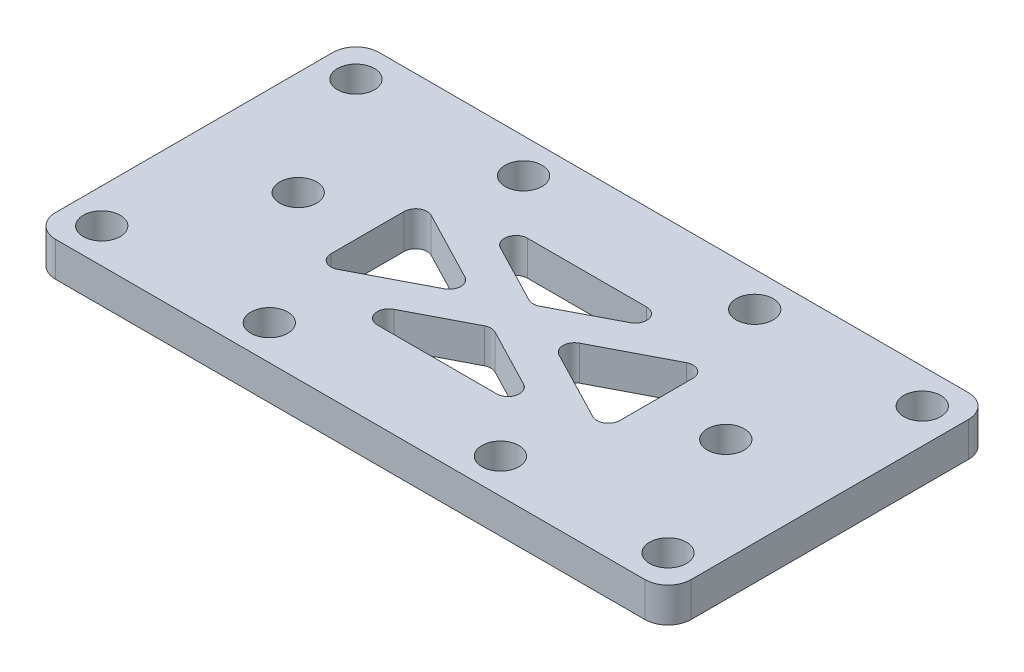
ISO-10303-21;
HEADER;
FILE_DESCRIPTION(('STEP AP214'),'2;1');
FILE_NAME('part.step','',(''),(''),'','','');
FILE_SCHEMA(('AUTOMOTIVE_DESIGN { 1 0 10303 214 1 1 1 1 }'));
ENDSEC;
DATA;
#1=APPLICATION_CONTEXT('core data for automotive mechanical design processes');
#2=APPLICATION_PROTOCOL_DEFINITION('international standard','automotive_design',2000,#1);
#3=PRODUCT_CONTEXT('',#1,'mechanical');
#4=PRODUCT('Part','Part','',(#3));
#5=PRODUCT_RELATED_PRODUCT_CATEGORY('part','',(#4));
#6=PRODUCT_DEFINITION_FORMATION('','',#4);
#7=PRODUCT_DEFINITION_CONTEXT('part definition',#1,'design');
#8=PRODUCT_DEFINITION('design','',#6,#7);
#9=PRODUCT_DEFINITION_SHAPE('','',#8);
#10=(LENGTH_UNIT() NAMED_UNIT(*) SI_UNIT(.MILLI.,.METRE.));
#11=(NAMED_UNIT(*) PLANE_ANGLE_UNIT() SI_UNIT($,.RADIAN.));
#12=(NAMED_UNIT(*) SI_UNIT($,.STERADIAN.) SOLID_ANGLE_UNIT());
#13=UNCERTAINTY_MEASURE_WITH_UNIT(LENGTH_MEASURE(1.E-05),#10,'distance_accuracy_value','');
#14=(GEOMETRIC_REPRESENTATION_CONTEXT(3) GLOBAL_UNCERTAINTY_ASSIGNED_CONTEXT((#13)) GLOBAL_UNIT_ASSIGNED_CONTEXT((#10,
#11,#12)) REPRESENTATION_CONTEXT('',''));
#15=CARTESIAN_POINT('',(0.,0.,0.));
#16=DIRECTION('',(0.,0.,1.));
#17=DIRECTION('',(1.,0.,0.));
#18=AXIS2_PLACEMENT_3D('',#15,#16,#17);
#19=CARTESIAN_POINT('',(0.,3.,0.));
#20=DIRECTION('',(0.,-1.,0.));
#21=DIRECTION('',(0.,0.,-1.));
#22=AXIS2_PLACEMENT_3D('',#19,#20,#21);
#23=PLANE('',#22);
#24=CARTESIAN_POINT('',(-18.5,3.,0.));
#25=DIRECTION('',(0.,1.,0.));
#26=DIRECTION('',(0.,0.,-1.));
#27=AXIS2_PLACEMENT_3D('',#24,#25,#26);
#28=CIRCLE('',#27,1.6);
#29=CARTESIAN_POINT('',(-18.5,3.,-1.60000000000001));
#30=VERTEX_POINT('',#29);
#31=EDGE_CURVE('E945',#30,#30,#28,.T.);
#32=ORIENTED_EDGE('',*,*,#31,.F.);
#33=EDGE_LOOP('',(#32));
#34=FACE_BOUND('',#33,.T.);
#35=CARTESIAN_POINT('',(-10.,3.,11.));
#36=DIRECTION('',(0.,1.,0.));
#37=DIRECTION('',(0.,0.,-1.));
#38=AXIS2_PLACEMENT_3D('',#35,#36,#37);
#39=CIRCLE('',#38,1.6);
#40=CARTESIAN_POINT('',(-10.,3.,9.39999999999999));
#41=VERTEX_POINT('',#40);
#42=EDGE_CURVE('E940',#41,#41,#39,.T.);
#43=ORIENTED_EDGE('',*,*,#42,.F.);
#44=EDGE_LOOP('',(#43));
#45=FACE_BOUND('',#44,.T.);
#46=CARTESIAN_POINT('',(9.99999999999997,3.,-11.));
#47=DIRECTION('',(0.,1.,0.));
#48=DIRECTION('',(0.,0.,-1.));
#49=AXIS2_PLACEMENT_3D('',#46,#47,#48);
#50=CIRCLE('',#49,1.6);
#51=CARTESIAN_POINT('',(9.99999999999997,3.,-12.6));
#52=VERTEX_POINT('',#51);
#53=EDGE_CURVE('E952',#52,#52,#50,.T.);
#54=ORIENTED_EDGE('',*,*,#53,.F.);
#55=EDGE_LOOP('',(#54));
#56=FACE_BOUND('',#55,.T.);
#57=CARTESIAN_POINT('',(-10.,3.,-11.));
#58=DIRECTION('',(0.,1.,0.));
#59=DIRECTION('',(0.,0.,1.));
#60=AXIS2_PLACEMENT_3D('',#57,#58,#59);
#61=CIRCLE('',#60,1.6);
#62=CARTESIAN_POINT('',(-10.,3.,-9.4));
#63=VERTEX_POINT('',#62);
#64=EDGE_CURVE('E953',#63,#63,#61,.T.);
#65=ORIENTED_EDGE('',*,*,#64,.F.);
#66=EDGE_LOOP('',(#65));
#67=FACE_BOUND('',#66,.T.);
#68=CARTESIAN_POINT('',(18.5,3.,0.));
#69=DIRECTION('',(0.,1.,0.));
#70=DIRECTION('',(0.,0.,1.));
#71=AXIS2_PLACEMENT_3D('',#68,#69,#70);
#72=CIRCLE('',#71,1.6);
#73=CARTESIAN_POINT('',(18.5,3.,1.6));
#74=VERTEX_POINT('',#73);
#75=EDGE_CURVE('E963',#74,#74,#72,.T.);
#76=ORIENTED_EDGE('',*,*,#75,.F.);
#77=EDGE_LOOP('',(#76));
#78=FACE_BOUND('',#77,.T.);
#79=CARTESIAN_POINT('',(10.,3.,11.));
#80=DIRECTION('',(0.,1.,0.));
#81=DIRECTION('',(0.,0.,1.));
#82=AXIS2_PLACEMENT_3D('',#79,#80,#81);
#83=CIRCLE('',#82,1.6);
#84=CARTESIAN_POINT('',(10.,3.,12.6));
#85=VERTEX_POINT('',#84);
#86=EDGE_CURVE('E935',#85,#85,#83,.T.);
#87=ORIENTED_EDGE('',*,*,#86,.F.);
#88=EDGE_LOOP('',(#87));
#89=FACE_BOUND('',#88,.T.);
#90=CARTESIAN_POINT('',(-24.5,3.,-11.));
#91=DIRECTION('',(0.,1.,0.));
#92=DIRECTION('',(0.,0.,1.));
#93=AXIS2_PLACEMENT_3D('',#90,#91,#92);
#94=CIRCLE('',#93,1.6);
#95=CARTESIAN_POINT('',(-24.5,3.,-9.40000000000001));
#96=VERTEX_POINT('',#95);
#97=EDGE_CURVE('E696',#96,#96,#94,.T.);
#98=ORIENTED_EDGE('',*,*,#97,.F.);
#99=EDGE_LOOP('',(#98));
#100=FACE_BOUND('',#99,.T.);
#101=DIRECTION('',(0.887216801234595,0.,-0.46135273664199));
#102=VECTOR('',#101,1.);
#103=CARTESIAN_POINT('',(0.692029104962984,3.,1.33082520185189));
#104=LINE('',#103,#102);
#105=CARTESIAN_POINT('',(-5.61942858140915,3.,4.6127831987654));
#106=VERTEX_POINT('',#105);
#107=CARTESIAN_POINT('',(-0.461352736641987,3.,1.93058375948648));
#108=VERTEX_POINT('',#107);
#109=EDGE_CURVE('E726',#106,#108,#104,.T.);
#110=ORIENTED_EDGE('',*,*,#109,.T.);
#111=CARTESIAN_POINT('',(0.,3.,2.81780056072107));
#112=DIRECTION('',(0.,-1.,0.));
#113=DIRECTION('',(0.,0.,-1.));
#114=AXIS2_PLACEMENT_3D('',#111,#112,#113);
#115=CIRCLE('',#114,1.);
#116=CARTESIAN_POINT('',(0.461352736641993,3.,1.93058375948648));
#117=VERTEX_POINT('',#116);
#118=EDGE_CURVE('E467',#108,#117,#115,.T.);
#119=ORIENTED_EDGE('',*,*,#118,.T.);
#120=DIRECTION('',(0.887216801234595,0.,0.46135273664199));
#121=VECTOR('',#120,1.);
#122=CARTESIAN_POINT('',(-0.692029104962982,3.,1.33082520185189));
#123=LINE('',#122,#121);
#124=CARTESIAN_POINT('',(5.61942858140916,3.,4.6127831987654));
#125=VERTEX_POINT('',#124);
#126=EDGE_CURVE('E710',#117,#125,#123,.T.);
#127=ORIENTED_EDGE('',*,*,#126,.T.);
#128=CARTESIAN_POINT('',(5.15807584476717,3.,5.5));
#129=DIRECTION('',(0.,-1.,0.));
#130=DIRECTION('',(0.,0.,-1.));
#131=AXIS2_PLACEMENT_3D('',#128,#129,#130);
#132=CIRCLE('',#131,1.);
#133=CARTESIAN_POINT('',(5.15807584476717,3.,6.5));
#134=VERTEX_POINT('',#133);
#135=EDGE_CURVE('E471',#125,#134,#132,.T.);
#136=ORIENTED_EDGE('',*,*,#135,.T.);
#137=DIRECTION('',(1.,0.,0.));
#138=VECTOR('',#137,1.);
#139=CARTESIAN_POINT('',(0.,3.,6.5));
#140=LINE('',#139,#138);
#141=CARTESIAN_POINT('',(-5.15807584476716,3.,6.5));
#142=VERTEX_POINT('',#141);
#143=EDGE_CURVE('E721',#142,#134,#140,.T.);
#144=ORIENTED_EDGE('',*,*,#143,.F.);
#145=CARTESIAN_POINT('',(-5.15807584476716,3.,5.5));
#146=DIRECTION('',(0.,-1.,0.));
#147=DIRECTION('',(0.,0.,-1.));
#148=AXIS2_PLACEMENT_3D('',#145,#146,#147);
#149=CIRCLE('',#148,1.);
#150=EDGE_CURVE('E463',#142,#106,#149,.T.);
#151=ORIENTED_EDGE('',*,*,#150,.T.);
#152=EDGE_LOOP('',(#110,#119,#127,#136,#144,#151));
#153=FACE_BOUND('',#152,.T.);
#154=CARTESIAN_POINT('',(24.5,3.,11.));
#155=DIRECTION('',(0.,1.,0.));
#156=DIRECTION('',(0.,0.,1.));
#157=AXIS2_PLACEMENT_3D('',#154,#155,#156);
#158=CIRCLE('',#157,1.6);
#159=CARTESIAN_POINT('',(24.5,3.,12.6));
#160=VERTEX_POINT('',#159);
#161=EDGE_CURVE('E913',#160,#160,#158,.F.);
#162=ORIENTED_EDGE('',*,*,#161,.T.);
#163=EDGE_LOOP('',(#162));
#164=FACE_BOUND('',#163,.T.);
#165=CARTESIAN_POINT('',(24.5,3.,-11.));
#166=DIRECTION('',(0.,1.,0.));
#167=DIRECTION('',(0.,0.,1.));
#168=AXIS2_PLACEMENT_3D('',#165,#166,#167);
#169=CIRCLE('',#168,1.6);
#170=CARTESIAN_POINT('',(24.5,3.,-9.40000000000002));
#171=VERTEX_POINT('',#170);
#172=EDGE_CURVE('E921',#171,#171,#169,.F.);
#173=ORIENTED_EDGE('',*,*,#172,.T.);
#174=EDGE_LOOP('',(#173));
#175=FACE_BOUND('',#174,.T.);
#176=DIRECTION('',(0.,0.,-1.));
#177=VECTOR('',#176,1.);
#178=CARTESIAN_POINT('',(-12.5,3.,0.));
#179=LINE('',#178,#177);
#180=CARTESIAN_POINT('',(-12.5,3.,3.16219943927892));
#181=VERTEX_POINT('',#180);
#182=CARTESIAN_POINT('',(-12.5,3.,-3.16219943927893));
#183=VERTEX_POINT('',#182);
#184=EDGE_CURVE('E499',#181,#183,#179,.T.);
#185=ORIENTED_EDGE('',*,*,#184,.T.);
#186=CARTESIAN_POINT('',(-11.5,3.,-3.16219943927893));
#187=DIRECTION('',(0.,-1.,0.));
#188=DIRECTION('',(0.,0.,-1.));
#189=AXIS2_PLACEMENT_3D('',#186,#187,#188);
#190=CIRCLE('',#189,1.);
#191=CARTESIAN_POINT('',(-11.038647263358,3.,-4.04941624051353));
#192=VERTEX_POINT('',#191);
#193=EDGE_CURVE('E487',#183,#192,#190,.T.);
#194=ORIENTED_EDGE('',*,*,#193,.T.);
#195=DIRECTION('',(0.887216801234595,0.,0.46135273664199));
#196=VECTOR('',#195,1.);
#197=CARTESIAN_POINT('',(-0.692029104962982,3.,1.33082520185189));
#198=LINE('',#197,#196);
#199=CARTESIAN_POINT('',(-4.95749449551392,3.,-0.887216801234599));
#200=VERTEX_POINT('',#199);
#201=EDGE_CURVE('E508',#192,#200,#198,.T.);
#202=ORIENTED_EDGE('',*,*,#201,.T.);
#203=CARTESIAN_POINT('',(-5.41884723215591,3.,0.));
#204=DIRECTION('',(0.,-1.,0.));
#205=DIRECTION('',(0.,0.,-1.));
#206=AXIS2_PLACEMENT_3D('',#203,#204,#205);
#207=CIRCLE('',#206,1.);
#208=CARTESIAN_POINT('',(-4.95749449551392,3.,0.887216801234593));
#209=VERTEX_POINT('',#208);
#210=EDGE_CURVE('E491',#200,#209,#207,.T.);
#211=ORIENTED_EDGE('',*,*,#210,.T.);
#212=DIRECTION('',(0.887216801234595,0.,-0.46135273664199));
#213=VECTOR('',#212,1.);
#214=CARTESIAN_POINT('',(-0.692029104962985,3.,-1.33082520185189));
#215=LINE('',#214,#213);
#216=CARTESIAN_POINT('',(-11.038647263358,3.,4.04941624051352));
#217=VERTEX_POINT('',#216);
#218=EDGE_CURVE('E500',#217,#209,#215,.T.);
#219=ORIENTED_EDGE('',*,*,#218,.F.);
#220=CARTESIAN_POINT('',(-11.5,3.,3.16219943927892));
#221=DIRECTION('',(0.,-1.,0.));
#222=DIRECTION('',(0.,0.,-1.));
#223=AXIS2_PLACEMENT_3D('',#220,#221,#222);
#224=CIRCLE('',#223,1.);
#225=EDGE_CURVE('E123',#217,#181,#224,.T.);
#226=ORIENTED_EDGE('',*,*,#225,.T.);
#227=EDGE_LOOP('',(#185,#194,#202,#211,#219,#226));
#228=FACE_BOUND('',#227,.T.);
#229=DIRECTION('',(1.,0.,0.));
#230=VECTOR('',#229,1.);
#231=CARTESIAN_POINT('',(-27.5,3.,14.));
#232=LINE('',#231,#230);
#233=CARTESIAN_POINT('',(-25.5,3.,14.));
#234=VERTEX_POINT('',#233);
#235=CARTESIAN_POINT('',(25.5,3.,14.));
#236=VERTEX_POINT('',#235);
#237=EDGE_CURVE('E360',#234,#236,#232,.T.);
#238=ORIENTED_EDGE('',*,*,#237,.T.);
#239=CARTESIAN_POINT('',(25.5,3.,12.));
#240=DIRECTION('',(0.,-1.,0.));
#241=DIRECTION('',(0.,0.,-1.));
#242=AXIS2_PLACEMENT_3D('',#239,#240,#241);
#243=CIRCLE('',#242,2.);
#244=CARTESIAN_POINT('',(27.5,3.,12.));
#245=VERTEX_POINT('',#244);
#246=EDGE_CURVE('E380',#236,#245,#243,.F.);
#247=ORIENTED_EDGE('',*,*,#246,.T.);
#248=DIRECTION('',(0.,0.,-1.));
#249=VECTOR('',#248,1.);
#250=CARTESIAN_POINT('',(27.5,3.,14.));
#251=LINE('',#250,#249);
#252=CARTESIAN_POINT('',(27.5,3.,-12.));
#253=VERTEX_POINT('',#252);
#254=EDGE_CURVE('E344',#245,#253,#251,.T.);
#255=ORIENTED_EDGE('',*,*,#254,.T.);
#256=CARTESIAN_POINT('',(25.5,3.,-12.));
#257=DIRECTION('',(0.,-1.,0.));
#258=DIRECTION('',(0.,0.,-1.));
#259=AXIS2_PLACEMENT_3D('',#256,#257,#258);
#260=CIRCLE('',#259,2.);
#261=CARTESIAN_POINT('',(25.5,3.,-14.));
#262=VERTEX_POINT('',#261);
#263=EDGE_CURVE('E376',#253,#262,#260,.F.);
#264=ORIENTED_EDGE('',*,*,#263,.T.);
#265=DIRECTION('',(-1.,0.,0.));
#266=VECTOR('',#265,1.);
#267=CARTESIAN_POINT('',(-27.5,3.,-14.));
#268=LINE('',#267,#266);
#269=CARTESIAN_POINT('',(-25.5,3.,-14.));
#270=VERTEX_POINT('',#269);
#271=EDGE_CURVE('E533',#262,#270,#268,.T.);
#272=ORIENTED_EDGE('',*,*,#271,.T.);
#273=CARTESIAN_POINT('',(-25.5,3.,-12.));
#274=DIRECTION('',(0.,-1.,0.));
#275=DIRECTION('',(0.,0.,-1.));
#276=AXIS2_PLACEMENT_3D('',#273,#274,#275);
#277=CIRCLE('',#276,2.);
#278=CARTESIAN_POINT('',(-27.5,3.,-12.));
#279=VERTEX_POINT('',#278);
#280=EDGE_CURVE('E374',#270,#279,#277,.F.);
#281=ORIENTED_EDGE('',*,*,#280,.T.);
#282=DIRECTION('',(0.,0.,1.));
#283=VECTOR('',#282,1.);
#284=CARTESIAN_POINT('',(-27.5,3.,14.));
#285=LINE('',#284,#283);
#286=CARTESIAN_POINT('',(-27.5,3.,12.));
#287=VERTEX_POINT('',#286);
#288=EDGE_CURVE('E535',#279,#287,#285,.T.);
#289=ORIENTED_EDGE('',*,*,#288,.T.);
#290=CARTESIAN_POINT('',(-25.5,3.,12.));
#291=DIRECTION('',(0.,-1.,0.));
#292=DIRECTION('',(0.,0.,-1.));
#293=AXIS2_PLACEMENT_3D('',#290,#291,#292);
#294=CIRCLE('',#293,2.);
#295=EDGE_CURVE('E378',#287,#234,#294,.F.);
#296=ORIENTED_EDGE('',*,*,#295,.T.);
#297=EDGE_LOOP('',(#238,#247,#255,#264,#272,#281,#289,#296));
#298=FACE_BOUND('',#297,.T.);
#299=CARTESIAN_POINT('',(-24.5,3.,11.));
#300=DIRECTION('',(0.,1.,0.));
#301=DIRECTION('',(0.,0.,1.));
#302=AXIS2_PLACEMENT_3D('',#299,#300,#301);
#303=CIRCLE('',#302,1.6);
#304=CARTESIAN_POINT('',(-24.5,3.,12.6));
#305=VERTEX_POINT('',#304);
#306=EDGE_CURVE('E908',#305,#305,#303,.T.);
#307=ORIENTED_EDGE('',*,*,#306,.F.);
#308=EDGE_LOOP('',(#307));
#309=FACE_BOUND('',#308,.T.);
#310=DIRECTION('',(0.887216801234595,0.,0.46135273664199));
#311=VECTOR('',#310,1.);
#312=CARTESIAN_POINT('',(0.692029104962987,3.,-1.3308252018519));
#313=LINE('',#312,#311);
#314=CARTESIAN_POINT('',(4.95749449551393,3.,0.887216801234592));
#315=VERTEX_POINT('',#314);
#316=CARTESIAN_POINT('',(11.038647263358,3.,4.04941624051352));
#317=VERTEX_POINT('',#316);
#318=EDGE_CURVE('E713',#315,#317,#313,.T.);
#319=ORIENTED_EDGE('',*,*,#318,.F.);
#320=CARTESIAN_POINT('',(5.41884723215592,3.,0.));
#321=DIRECTION('',(0.,-1.,0.));
#322=DIRECTION('',(0.,0.,-1.));
#323=AXIS2_PLACEMENT_3D('',#320,#321,#322);
#324=CIRCLE('',#323,1.);
#325=CARTESIAN_POINT('',(4.95749449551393,3.,-0.8872168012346));
#326=VERTEX_POINT('',#325);
#327=EDGE_CURVE('E479',#315,#326,#324,.T.);
#328=ORIENTED_EDGE('',*,*,#327,.T.);
#329=DIRECTION('',(0.887216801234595,0.,-0.46135273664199));
#330=VECTOR('',#329,1.);
#331=CARTESIAN_POINT('',(0.692029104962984,3.,1.33082520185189));
#332=LINE('',#331,#330);
#333=CARTESIAN_POINT('',(11.038647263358,3.,-4.04941624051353));
#334=VERTEX_POINT('',#333);
#335=EDGE_CURVE('E672',#326,#334,#332,.T.);
#336=ORIENTED_EDGE('',*,*,#335,.T.);
#337=CARTESIAN_POINT('',(11.5,3.,-3.16219943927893));
#338=DIRECTION('',(0.,-1.,0.));
#339=DIRECTION('',(0.,0.,-1.));
#340=AXIS2_PLACEMENT_3D('',#337,#338,#339);
#341=CIRCLE('',#340,1.);
#342=CARTESIAN_POINT('',(12.5,3.,-3.16219943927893));
#343=VERTEX_POINT('',#342);
#344=EDGE_CURVE('E483',#334,#343,#341,.T.);
#345=ORIENTED_EDGE('',*,*,#344,.T.);
#346=DIRECTION('',(0.,0.,-1.));
#347=VECTOR('',#346,1.);
#348=CARTESIAN_POINT('',(12.5,3.,0.));
#349=LINE('',#348,#347);
#350=CARTESIAN_POINT('',(12.5,3.,3.16219943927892));
#351=VERTEX_POINT('',#350);
#352=EDGE_CURVE('E704',#351,#343,#349,.T.);
#353=ORIENTED_EDGE('',*,*,#352,.F.);
#354=CARTESIAN_POINT('',(11.5,3.,3.16219943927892));
#355=DIRECTION('',(0.,-1.,0.));
#356=DIRECTION('',(0.,0.,-1.));
#357=AXIS2_PLACEMENT_3D('',#354,#355,#356);
#358=CIRCLE('',#357,1.);
#359=EDGE_CURVE('E475',#351,#317,#358,.T.);
#360=ORIENTED_EDGE('',*,*,#359,.T.);
#361=EDGE_LOOP('',(#319,#328,#336,#345,#353,#360));
#362=FACE_BOUND('',#361,.T.);
#363=DIRECTION('',(0.887216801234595,0.,0.46135273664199));
#364=VECTOR('',#363,1.);
#365=CARTESIAN_POINT('',(0.692029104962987,3.,-1.3308252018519));
#366=LINE('',#365,#364);
#367=CARTESIAN_POINT('',(-5.61942858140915,3.,-4.61278319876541));
#368=VERTEX_POINT('',#367);
#369=CARTESIAN_POINT('',(-0.461352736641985,3.,-1.93058375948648));
#370=VERTEX_POINT('',#369);
#371=EDGE_CURVE('E681',#368,#370,#366,.T.);
#372=ORIENTED_EDGE('',*,*,#371,.F.);
#373=CARTESIAN_POINT('',(-5.15807584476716,3.,-5.5));
#374=DIRECTION('',(0.,-1.,0.));
#375=DIRECTION('',(0.,0.,-1.));
#376=AXIS2_PLACEMENT_3D('',#373,#374,#375);
#377=CIRCLE('',#376,1.);
#378=CARTESIAN_POINT('',(-5.15807584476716,3.,-6.5));
#379=VERTEX_POINT('',#378);
#380=EDGE_CURVE('E455',#368,#379,#377,.T.);
#381=ORIENTED_EDGE('',*,*,#380,.T.);
#382=DIRECTION('',(1.,0.,0.));
#383=VECTOR('',#382,1.);
#384=CARTESIAN_POINT('',(0.,3.,-6.5));
#385=LINE('',#384,#383);
#386=CARTESIAN_POINT('',(5.15807584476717,3.,-6.5));
#387=VERTEX_POINT('',#386);
#388=EDGE_CURVE('E686',#379,#387,#385,.T.);
#389=ORIENTED_EDGE('',*,*,#388,.T.);
#390=CARTESIAN_POINT('',(5.15807584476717,3.,-5.5));
#391=DIRECTION('',(0.,-1.,0.));
#392=DIRECTION('',(0.,0.,-1.));
#393=AXIS2_PLACEMENT_3D('',#390,#391,#392);
#394=CIRCLE('',#393,1.);
#395=CARTESIAN_POINT('',(5.61942858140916,3.,-4.61278319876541));
#396=VERTEX_POINT('',#395);
#397=EDGE_CURVE('E459',#387,#396,#394,.T.);
#398=ORIENTED_EDGE('',*,*,#397,.T.);
#399=DIRECTION('',(0.887216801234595,0.,-0.46135273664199));
#400=VECTOR('',#399,1.);
#401=CARTESIAN_POINT('',(-0.692029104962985,3.,-1.33082520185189));
#402=LINE('',#401,#400);
#403=CARTESIAN_POINT('',(0.461352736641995,3.,-1.93058375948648));
#404=VERTEX_POINT('',#403);
#405=EDGE_CURVE('E682',#404,#396,#402,.T.);
#406=ORIENTED_EDGE('',*,*,#405,.F.);
#407=CARTESIAN_POINT('',(0.,3.,-2.81780056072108));
#408=DIRECTION('',(0.,-1.,0.));
#409=DIRECTION('',(0.,0.,-1.));
#410=AXIS2_PLACEMENT_3D('',#407,#408,#409);
#411=CIRCLE('',#410,1.);
#412=EDGE_CURVE('E451',#404,#370,#411,.T.);
#413=ORIENTED_EDGE('',*,*,#412,.T.);
#414=EDGE_LOOP('',(#372,#381,#389,#398,#406,#413));
#415=FACE_BOUND('',#414,.T.);
#416=ADVANCED_FACE('F115',(#34,#45,#56,#67,#78,#89,#100,#153,#164,#175,#228,#298,#309,#362,
#415),#23,.F.);
#417=CARTESIAN_POINT('',(0.,0.,0.));
#418=DIRECTION('',(0.,-1.,0.));
#419=DIRECTION('',(0.,0.,-1.));
#420=AXIS2_PLACEMENT_3D('',#417,#418,#419);
#421=PLANE('',#420);
#422=CARTESIAN_POINT('',(-18.5,0.,0.));
#423=DIRECTION('',(0.,1.,0.));
#424=DIRECTION('',(0.,0.,-1.));
#425=AXIS2_PLACEMENT_3D('',#422,#423,#424);
#426=CIRCLE('',#425,1.6);
#427=CARTESIAN_POINT('',(-18.5,0.,-1.60000000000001));
#428=VERTEX_POINT('',#427);
#429=EDGE_CURVE('E942',#428,#428,#426,.T.);
#430=ORIENTED_EDGE('',*,*,#429,.T.);
#431=EDGE_LOOP('',(#430));
#432=FACE_BOUND('',#431,.T.);
#433=CARTESIAN_POINT('',(-10.,0.,11.));
#434=DIRECTION('',(0.,1.,0.));
#435=DIRECTION('',(0.,0.,-1.));
#436=AXIS2_PLACEMENT_3D('',#433,#434,#435);
#437=CIRCLE('',#436,1.6);
#438=CARTESIAN_POINT('',(-10.,0.,9.39999999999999));
#439=VERTEX_POINT('',#438);
#440=EDGE_CURVE('E956',#439,#439,#437,.T.);
#441=ORIENTED_EDGE('',*,*,#440,.T.);
#442=EDGE_LOOP('',(#441));
#443=FACE_BOUND('',#442,.T.);
#444=CARTESIAN_POINT('',(9.99999999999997,0.,-11.));
#445=DIRECTION('',(0.,1.,0.));
#446=DIRECTION('',(0.,0.,-1.));
#447=AXIS2_PLACEMENT_3D('',#444,#445,#446);
#448=CIRCLE('',#447,1.6);
#449=CARTESIAN_POINT('',(9.99999999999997,0.,-12.6));
#450=VERTEX_POINT('',#449);
#451=EDGE_CURVE('E949',#450,#450,#448,.T.);
#452=ORIENTED_EDGE('',*,*,#451,.T.);
#453=EDGE_LOOP('',(#452));
#454=FACE_BOUND('',#453,.T.);
#455=CARTESIAN_POINT('',(-10.,0.,-11.));
#456=DIRECTION('',(0.,1.,0.));
#457=DIRECTION('',(0.,0.,1.));
#458=AXIS2_PLACEMENT_3D('',#455,#456,#457);
#459=CIRCLE('',#458,1.6);
#460=CARTESIAN_POINT('',(-10.,0.,-9.4));
#461=VERTEX_POINT('',#460);
#462=EDGE_CURVE('E966',#461,#461,#459,.T.);
#463=ORIENTED_EDGE('',*,*,#462,.T.);
#464=EDGE_LOOP('',(#463));
#465=FACE_BOUND('',#464,.T.);
#466=CARTESIAN_POINT('',(18.5,0.,0.));
#467=DIRECTION('',(0.,1.,0.));
#468=DIRECTION('',(0.,0.,1.));
#469=AXIS2_PLACEMENT_3D('',#466,#467,#468);
#470=CIRCLE('',#469,1.6);
#471=CARTESIAN_POINT('',(18.5,0.,1.6));
#472=VERTEX_POINT('',#471);
#473=EDGE_CURVE('E948',#472,#472,#470,.T.);
#474=ORIENTED_EDGE('',*,*,#473,.T.);
#475=EDGE_LOOP('',(#474));
#476=FACE_BOUND('',#475,.T.);
#477=CARTESIAN_POINT('',(10.,0.,11.));
#478=DIRECTION('',(0.,1.,0.));
#479=DIRECTION('',(0.,0.,1.));
#480=AXIS2_PLACEMENT_3D('',#477,#478,#479);
#481=CIRCLE('',#480,1.6);
#482=CARTESIAN_POINT('',(10.,0.,12.6));
#483=VERTEX_POINT('',#482);
#484=EDGE_CURVE('E924',#483,#483,#481,.T.);
#485=ORIENTED_EDGE('',*,*,#484,.T.);
#486=EDGE_LOOP('',(#485));
#487=FACE_BOUND('',#486,.T.);
#488=CARTESIAN_POINT('',(-24.5,0.,-11.));
#489=DIRECTION('',(0.,1.,0.));
#490=DIRECTION('',(0.,0.,1.));
#491=AXIS2_PLACEMENT_3D('',#488,#489,#490);
#492=CIRCLE('',#491,1.6);
#493=CARTESIAN_POINT('',(-24.5,0.,-9.40000000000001));
#494=VERTEX_POINT('',#493);
#495=EDGE_CURVE('E691',#494,#494,#492,.T.);
#496=ORIENTED_EDGE('',*,*,#495,.T.);
#497=EDGE_LOOP('',(#496));
#498=FACE_BOUND('',#497,.T.);
#499=CARTESIAN_POINT('',(-24.5,0.,11.));
#500=DIRECTION('',(0.,1.,0.));
#501=DIRECTION('',(0.,0.,1.));
#502=AXIS2_PLACEMENT_3D('',#499,#500,#501);
#503=CIRCLE('',#502,1.6);
#504=CARTESIAN_POINT('',(-24.5,0.,12.6));
#505=VERTEX_POINT('',#504);
#506=EDGE_CURVE('E699',#505,#505,#503,.T.);
#507=ORIENTED_EDGE('',*,*,#506,.T.);
#508=EDGE_LOOP('',(#507));
#509=FACE_BOUND('',#508,.T.);
#510=CARTESIAN_POINT('',(24.5,0.,-11.));
#511=DIRECTION('',(0.,1.,0.));
#512=DIRECTION('',(0.,0.,1.));
#513=AXIS2_PLACEMENT_3D('',#510,#511,#512);
#514=CIRCLE('',#513,1.6);
#515=CARTESIAN_POINT('',(24.5,0.,-9.40000000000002));
#516=VERTEX_POINT('',#515);
#517=EDGE_CURVE('E919',#516,#516,#514,.F.);
#518=ORIENTED_EDGE('',*,*,#517,.F.);
#519=EDGE_LOOP('',(#518));
#520=FACE_BOUND('',#519,.T.);
#521=DIRECTION('',(0.,0.,-1.));
#522=VECTOR('',#521,1.);
#523=CARTESIAN_POINT('',(27.5,0.,14.));
#524=LINE('',#523,#522);
#525=CARTESIAN_POINT('',(27.5,0.,12.));
#526=VERTEX_POINT('',#525);
#527=CARTESIAN_POINT('',(27.5,0.,-12.));
#528=VERTEX_POINT('',#527);
#529=EDGE_CURVE('E341',#526,#528,#524,.T.);
#530=ORIENTED_EDGE('',*,*,#529,.F.);
#531=CARTESIAN_POINT('',(25.5,0.,12.));
#532=DIRECTION('',(0.,-1.,0.));
#533=DIRECTION('',(0.,0.,-1.));
#534=AXIS2_PLACEMENT_3D('',#531,#532,#533);
#535=CIRCLE('',#534,2.);
#536=CARTESIAN_POINT('',(25.5,0.,14.));
#537=VERTEX_POINT('',#536);
#538=EDGE_CURVE('E324',#526,#537,#535,.T.);
#539=ORIENTED_EDGE('',*,*,#538,.T.);
#540=DIRECTION('',(1.,0.,0.));
#541=VECTOR('',#540,1.);
#542=CARTESIAN_POINT('',(-27.5,0.,14.));
#543=LINE('',#542,#541);
#544=CARTESIAN_POINT('',(-25.5,0.,14.));
#545=VERTEX_POINT('',#544);
#546=EDGE_CURVE('E365',#545,#537,#543,.T.);
#547=ORIENTED_EDGE('',*,*,#546,.F.);
#548=CARTESIAN_POINT('',(-25.5,0.,12.));
#549=DIRECTION('',(0.,-1.,0.));
#550=DIRECTION('',(0.,0.,-1.));
#551=AXIS2_PLACEMENT_3D('',#548,#549,#550);
#552=CIRCLE('',#551,2.);
#553=CARTESIAN_POINT('',(-27.5,0.,12.));
#554=VERTEX_POINT('',#553);
#555=EDGE_CURVE('E335',#545,#554,#552,.T.);
#556=ORIENTED_EDGE('',*,*,#555,.T.);
#557=DIRECTION('',(0.,0.,1.));
#558=VECTOR('',#557,1.);
#559=CARTESIAN_POINT('',(-27.5,0.,14.));
#560=LINE('',#559,#558);
#561=CARTESIAN_POINT('',(-27.5,0.,-12.));
#562=VERTEX_POINT('',#561);
#563=EDGE_CURVE('E355',#562,#554,#560,.T.);
#564=ORIENTED_EDGE('',*,*,#563,.F.);
#565=CARTESIAN_POINT('',(-25.5,0.,-12.));
#566=DIRECTION('',(0.,-1.,0.));
#567=DIRECTION('',(0.,0.,-1.));
#568=AXIS2_PLACEMENT_3D('',#565,#566,#567);
#569=CIRCLE('',#568,2.);
#570=CARTESIAN_POINT('',(-25.5,0.,-14.));
#571=VERTEX_POINT('',#570);
#572=EDGE_CURVE('E345',#562,#571,#569,.T.);
#573=ORIENTED_EDGE('',*,*,#572,.T.);
#574=DIRECTION('',(-1.,0.,0.));
#575=VECTOR('',#574,1.);
#576=CARTESIAN_POINT('',(-27.5,0.,-14.));
#577=LINE('',#576,#575);
#578=CARTESIAN_POINT('',(25.5,0.,-14.));
#579=VERTEX_POINT('',#578);
#580=EDGE_CURVE('E351',#579,#571,#577,.T.);
#581=ORIENTED_EDGE('',*,*,#580,.F.);
#582=CARTESIAN_POINT('',(25.5,0.,-12.));
#583=DIRECTION('',(0.,-1.,0.));
#584=DIRECTION('',(0.,0.,-1.));
#585=AXIS2_PLACEMENT_3D('',#582,#583,#584);
#586=CIRCLE('',#585,2.);
#587=EDGE_CURVE('E350',#579,#528,#586,.T.);
#588=ORIENTED_EDGE('',*,*,#587,.T.);
#589=EDGE_LOOP('',(#530,#539,#547,#556,#564,#573,#581,#588));
#590=FACE_BOUND('',#589,.T.);
#591=DIRECTION('',(0.,0.,-1.));
#592=VECTOR('',#591,1.);
#593=CARTESIAN_POINT('',(-12.5,0.,0.));
#594=LINE('',#593,#592);
#595=CARTESIAN_POINT('',(-12.5,0.,3.16219943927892));
#596=VERTEX_POINT('',#595);
#597=CARTESIAN_POINT('',(-12.5,0.,-3.16219943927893));
#598=VERTEX_POINT('',#597);
#599=EDGE_CURVE('E357',#596,#598,#594,.T.);
#600=ORIENTED_EDGE('',*,*,#599,.F.);
#601=CARTESIAN_POINT('',(-11.5,0.,3.16219943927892));
#602=DIRECTION('',(0.,-1.,0.));
#603=DIRECTION('',(0.,0.,-1.));
#604=AXIS2_PLACEMENT_3D('',#601,#602,#603);
#605=CIRCLE('',#604,1.);
#606=CARTESIAN_POINT('',(-11.038647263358,0.,4.04941624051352));
#607=VERTEX_POINT('',#606);
#608=EDGE_CURVE('E12',#596,#607,#605,.F.);
#609=ORIENTED_EDGE('',*,*,#608,.T.);
#610=DIRECTION('',(0.887216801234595,0.,-0.46135273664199));
#611=VECTOR('',#610,1.);
#612=CARTESIAN_POINT('',(-0.692029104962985,0.,-1.33082520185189));
#613=LINE('',#612,#611);
#614=CARTESIAN_POINT('',(-4.95749449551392,0.,0.887216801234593));
#615=VERTEX_POINT('',#614);
#616=EDGE_CURVE('E352',#607,#615,#613,.T.);
#617=ORIENTED_EDGE('',*,*,#616,.T.);
#618=CARTESIAN_POINT('',(-5.41884723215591,0.,0.));
#619=DIRECTION('',(0.,-1.,0.));
#620=DIRECTION('',(0.,0.,-1.));
#621=AXIS2_PLACEMENT_3D('',#618,#619,#620);
#622=CIRCLE('',#621,1.);
#623=CARTESIAN_POINT('',(-4.95749449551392,0.,-0.887216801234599));
#624=VERTEX_POINT('',#623);
#625=EDGE_CURVE('E493',#615,#624,#622,.F.);
#626=ORIENTED_EDGE('',*,*,#625,.T.);
#627=DIRECTION('',(0.887216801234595,0.,0.46135273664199));
#628=VECTOR('',#627,1.);
#629=CARTESIAN_POINT('',(-0.692029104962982,0.,1.33082520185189));
#630=LINE('',#629,#628);
#631=CARTESIAN_POINT('',(-11.038647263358,0.,-4.04941624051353));
#632=VERTEX_POINT('',#631);
#633=EDGE_CURVE('E523',#632,#624,#630,.T.);
#634=ORIENTED_EDGE('',*,*,#633,.F.);
#635=CARTESIAN_POINT('',(-11.5,0.,-3.16219943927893));
#636=DIRECTION('',(0.,-1.,0.));
#637=DIRECTION('',(0.,0.,-1.));
#638=AXIS2_PLACEMENT_3D('',#635,#636,#637);
#639=CIRCLE('',#638,1.);
#640=EDGE_CURVE('E489',#632,#598,#639,.F.);
#641=ORIENTED_EDGE('',*,*,#640,.T.);
#642=EDGE_LOOP('',(#600,#609,#617,#626,#634,#641));
#643=FACE_BOUND('',#642,.T.);
#644=CARTESIAN_POINT('',(24.5,0.,11.));
#645=DIRECTION('',(0.,1.,0.));
#646=DIRECTION('',(0.,0.,1.));
#647=AXIS2_PLACEMENT_3D('',#644,#645,#646);
#648=CIRCLE('',#647,1.6);
#649=CARTESIAN_POINT('',(24.5,0.,12.6));
#650=VERTEX_POINT('',#649);
#651=EDGE_CURVE('E909',#650,#650,#648,.F.);
#652=ORIENTED_EDGE('',*,*,#651,.F.);
#653=EDGE_LOOP('',(#652));
#654=FACE_BOUND('',#653,.T.);
#655=DIRECTION('',(0.887216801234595,0.,0.46135273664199));
#656=VECTOR('',#655,1.);
#657=CARTESIAN_POINT('',(0.692029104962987,0.,-1.3308252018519));
#658=LINE('',#657,#656);
#659=CARTESIAN_POINT('',(4.95749449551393,0.,0.887216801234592));
#660=VERTEX_POINT('',#659);
#661=CARTESIAN_POINT('',(11.038647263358,0.,4.04941624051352));
#662=VERTEX_POINT('',#661);
#663=EDGE_CURVE('E703',#660,#662,#658,.T.);
#664=ORIENTED_EDGE('',*,*,#663,.T.);
#665=CARTESIAN_POINT('',(11.5,0.,3.16219943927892));
#666=DIRECTION('',(0.,-1.,0.));
#667=DIRECTION('',(0.,0.,-1.));
#668=AXIS2_PLACEMENT_3D('',#665,#666,#667);
#669=CIRCLE('',#668,1.);
#670=CARTESIAN_POINT('',(12.5,0.,3.16219943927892));
#671=VERTEX_POINT('',#670);
#672=EDGE_CURVE('E477',#662,#671,#669,.F.);
#673=ORIENTED_EDGE('',*,*,#672,.T.);
#674=DIRECTION('',(0.,0.,-1.));
#675=VECTOR('',#674,1.);
#676=CARTESIAN_POINT('',(12.5,0.,0.));
#677=LINE('',#676,#675);
#678=CARTESIAN_POINT('',(12.5,0.,-3.16219943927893));
#679=VERTEX_POINT('',#678);
#680=EDGE_CURVE('E707',#671,#679,#677,.T.);
#681=ORIENTED_EDGE('',*,*,#680,.T.);
#682=CARTESIAN_POINT('',(11.5,0.,-3.16219943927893));
#683=DIRECTION('',(0.,-1.,0.));
#684=DIRECTION('',(0.,0.,-1.));
#685=AXIS2_PLACEMENT_3D('',#682,#683,#684);
#686=CIRCLE('',#685,1.);
#687=CARTESIAN_POINT('',(11.038647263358,0.,-4.04941624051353));
#688=VERTEX_POINT('',#687);
#689=EDGE_CURVE('E485',#679,#688,#686,.F.);
#690=ORIENTED_EDGE('',*,*,#689,.T.);
#691=DIRECTION('',(0.887216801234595,0.,-0.46135273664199));
#692=VECTOR('',#691,1.);
#693=CARTESIAN_POINT('',(0.692029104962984,0.,1.33082520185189));
#694=LINE('',#693,#692);
#695=CARTESIAN_POINT('',(4.95749449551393,0.,-0.8872168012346));
#696=VERTEX_POINT('',#695);
#697=EDGE_CURVE('E700',#696,#688,#694,.T.);
#698=ORIENTED_EDGE('',*,*,#697,.F.);
#699=CARTESIAN_POINT('',(5.41884723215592,0.,0.));
#700=DIRECTION('',(0.,-1.,0.));
#701=DIRECTION('',(0.,0.,-1.));
#702=AXIS2_PLACEMENT_3D('',#699,#700,#701);
#703=CIRCLE('',#702,1.);
#704=EDGE_CURVE('E481',#696,#660,#703,.F.);
#705=ORIENTED_EDGE('',*,*,#704,.T.);
#706=EDGE_LOOP('',(#664,#673,#681,#690,#698,#705));
#707=FACE_BOUND('',#706,.T.);
#708=DIRECTION('',(0.887216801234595,0.,-0.46135273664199));
#709=VECTOR('',#708,1.);
#710=CARTESIAN_POINT('',(0.692029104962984,0.,1.33082520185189));
#711=LINE('',#710,#709);
#712=CARTESIAN_POINT('',(-5.61942858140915,0.,4.6127831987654));
#713=VERTEX_POINT('',#712);
#714=CARTESIAN_POINT('',(-0.461352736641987,0.,1.93058375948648));
#715=VERTEX_POINT('',#714);
#716=EDGE_CURVE('E527',#713,#715,#711,.T.);
#717=ORIENTED_EDGE('',*,*,#716,.F.);
#718=CARTESIAN_POINT('',(-5.15807584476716,0.,5.5));
#719=DIRECTION('',(0.,-1.,0.));
#720=DIRECTION('',(0.,0.,-1.));
#721=AXIS2_PLACEMENT_3D('',#718,#719,#720);
#722=CIRCLE('',#721,1.);
#723=CARTESIAN_POINT('',(-5.15807584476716,0.,6.5));
#724=VERTEX_POINT('',#723);
#725=EDGE_CURVE('E465',#713,#724,#722,.F.);
#726=ORIENTED_EDGE('',*,*,#725,.T.);
#727=DIRECTION('',(1.,0.,0.));
#728=VECTOR('',#727,1.);
#729=CARTESIAN_POINT('',(0.,0.,6.5));
#730=LINE('',#729,#728);
#731=CARTESIAN_POINT('',(5.15807584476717,0.,6.5));
#732=VERTEX_POINT('',#731);
#733=EDGE_CURVE('E524',#724,#732,#730,.T.);
#734=ORIENTED_EDGE('',*,*,#733,.T.);
#735=CARTESIAN_POINT('',(5.15807584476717,0.,5.5));
#736=DIRECTION('',(0.,-1.,0.));
#737=DIRECTION('',(0.,0.,-1.));
#738=AXIS2_PLACEMENT_3D('',#735,#736,#737);
#739=CIRCLE('',#738,1.);
#740=CARTESIAN_POINT('',(5.61942858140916,0.,4.6127831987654));
#741=VERTEX_POINT('',#740);
#742=EDGE_CURVE('E473',#732,#741,#739,.F.);
#743=ORIENTED_EDGE('',*,*,#742,.T.);
#744=DIRECTION('',(0.887216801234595,0.,0.46135273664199));
#745=VECTOR('',#744,1.);
#746=CARTESIAN_POINT('',(-0.692029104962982,0.,1.33082520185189));
#747=LINE('',#746,#745);
#748=CARTESIAN_POINT('',(0.461352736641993,0.,1.93058375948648));
#749=VERTEX_POINT('',#748);
#750=EDGE_CURVE('E718',#749,#741,#747,.T.);
#751=ORIENTED_EDGE('',*,*,#750,.F.);
#752=CARTESIAN_POINT('',(0.,0.,2.81780056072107));
#753=DIRECTION('',(0.,-1.,0.));
#754=DIRECTION('',(0.,0.,-1.));
#755=AXIS2_PLACEMENT_3D('',#752,#753,#754);
#756=CIRCLE('',#755,1.);
#757=EDGE_CURVE('E469',#749,#715,#756,.F.);
#758=ORIENTED_EDGE('',*,*,#757,.T.);
#759=EDGE_LOOP('',(#717,#726,#734,#743,#751,#758));
#760=FACE_BOUND('',#759,.T.);
#761=DIRECTION('',(0.887216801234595,0.,0.46135273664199));
#762=VECTOR('',#761,1.);
#763=CARTESIAN_POINT('',(0.692029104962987,0.,-1.3308252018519));
#764=LINE('',#763,#762);
#765=CARTESIAN_POINT('',(-5.61942858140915,0.,-4.61278319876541));
#766=VERTEX_POINT('',#765);
#767=CARTESIAN_POINT('',(-0.461352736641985,0.,-1.93058375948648));
#768=VERTEX_POINT('',#767);
#769=EDGE_CURVE('E673',#766,#768,#764,.T.);
#770=ORIENTED_EDGE('',*,*,#769,.T.);
#771=CARTESIAN_POINT('',(0.,0.,-2.81780056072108));
#772=DIRECTION('',(0.,-1.,0.));
#773=DIRECTION('',(0.,0.,-1.));
#774=AXIS2_PLACEMENT_3D('',#771,#772,#773);
#775=CIRCLE('',#774,1.);
#776=CARTESIAN_POINT('',(0.461352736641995,0.,-1.93058375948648));
#777=VERTEX_POINT('',#776);
#778=EDGE_CURVE('E453',#768,#777,#775,.F.);
#779=ORIENTED_EDGE('',*,*,#778,.T.);
#780=DIRECTION('',(0.887216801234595,0.,-0.46135273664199));
#781=VECTOR('',#780,1.);
#782=CARTESIAN_POINT('',(-0.692029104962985,0.,-1.33082520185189));
#783=LINE('',#782,#781);
#784=CARTESIAN_POINT('',(5.61942858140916,0.,-4.61278319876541));
#785=VERTEX_POINT('',#784);
#786=EDGE_CURVE('E665',#777,#785,#783,.T.);
#787=ORIENTED_EDGE('',*,*,#786,.T.);
#788=CARTESIAN_POINT('',(5.15807584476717,0.,-5.5));
#789=DIRECTION('',(0.,-1.,0.));
#790=DIRECTION('',(0.,0.,-1.));
#791=AXIS2_PLACEMENT_3D('',#788,#789,#790);
#792=CIRCLE('',#791,1.);
#793=CARTESIAN_POINT('',(5.15807584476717,0.,-6.5));
#794=VERTEX_POINT('',#793);
#795=EDGE_CURVE('E461',#785,#794,#792,.F.);
#796=ORIENTED_EDGE('',*,*,#795,.T.);
#797=DIRECTION('',(1.,0.,0.));
#798=VECTOR('',#797,1.);
#799=CARTESIAN_POINT('',(0.,0.,-6.5));
#800=LINE('',#799,#798);
#801=CARTESIAN_POINT('',(-5.15807584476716,0.,-6.5));
#802=VERTEX_POINT('',#801);
#803=EDGE_CURVE('E688',#802,#794,#800,.T.);
#804=ORIENTED_EDGE('',*,*,#803,.F.);
#805=CARTESIAN_POINT('',(-5.15807584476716,0.,-5.5));
#806=DIRECTION('',(0.,-1.,0.));
#807=DIRECTION('',(0.,0.,-1.));
#808=AXIS2_PLACEMENT_3D('',#805,#806,#807);
#809=CIRCLE('',#808,1.);
#810=EDGE_CURVE('E457',#802,#766,#809,.F.);
#811=ORIENTED_EDGE('',*,*,#810,.T.);
#812=EDGE_LOOP('',(#770,#779,#787,#796,#804,#811));
#813=FACE_BOUND('',#812,.T.);
#814=ADVANCED_FACE('F348',(#432,#443,#454,#465,#476,#487,#498,#509,#520,#590,#643,#654,#707,
#760,#813),#421,.T.);
#815=CARTESIAN_POINT('',(27.5,3.,14.));
#816=DIRECTION('',(-1.,0.,0.));
#817=DIRECTION('',(0.,0.,1.));
#818=AXIS2_PLACEMENT_3D('',#815,#816,#817);
#819=PLANE('',#818);
#820=ORIENTED_EDGE('',*,*,#254,.F.);
#821=DIRECTION('',(0.,-1.,0.));
#822=VECTOR('',#821,1.);
#823=CARTESIAN_POINT('',(27.5,3.,12.));
#824=LINE('',#823,#822);
#825=EDGE_CURVE('E328',#245,#526,#824,.T.);
#826=ORIENTED_EDGE('',*,*,#825,.T.);
#827=ORIENTED_EDGE('',*,*,#529,.T.);
#828=DIRECTION('',(0.,-1.,0.));
#829=VECTOR('',#828,1.);
#830=CARTESIAN_POINT('',(27.5,3.,-12.));
#831=LINE('',#830,#829);
#832=EDGE_CURVE('E346',#528,#253,#831,.F.);
#833=ORIENTED_EDGE('',*,*,#832,.T.);
#834=EDGE_LOOP('',(#820,#826,#827,#833));
#835=FACE_BOUND('',#834,.T.);
#836=ADVANCED_FACE('F340',(#835),#819,.F.);
#837=CARTESIAN_POINT('',(-27.5,3.,-14.));
#838=DIRECTION('',(0.,0.,1.));
#839=DIRECTION('',(1.,0.,0.));
#840=AXIS2_PLACEMENT_3D('',#837,#838,#839);
#841=PLANE('',#840);
#842=ORIENTED_EDGE('',*,*,#271,.F.);
#843=DIRECTION('',(0.,-1.,0.));
#844=VECTOR('',#843,1.);
#845=CARTESIAN_POINT('',(25.5,3.,-14.));
#846=LINE('',#845,#844);
#847=EDGE_CURVE('E389',#262,#579,#846,.T.);
#848=ORIENTED_EDGE('',*,*,#847,.T.);
#849=ORIENTED_EDGE('',*,*,#580,.T.);
#850=DIRECTION('',(0.,-1.,0.));
#851=VECTOR('',#850,1.);
#852=CARTESIAN_POINT('',(-25.5,3.,-14.));
#853=LINE('',#852,#851);
#854=EDGE_CURVE('E387',#571,#270,#853,.F.);
#855=ORIENTED_EDGE('',*,*,#854,.T.);
#856=EDGE_LOOP('',(#842,#848,#849,#855));
#857=FACE_BOUND('',#856,.T.);
#858=ADVANCED_FACE('F558',(#857),#841,.F.);
#859=CARTESIAN_POINT('',(-27.5,3.,14.));
#860=DIRECTION('',(1.,0.,0.));
#861=DIRECTION('',(0.,0.,-1.));
#862=AXIS2_PLACEMENT_3D('',#859,#860,#861);
#863=PLANE('',#862);
#864=ORIENTED_EDGE('',*,*,#563,.T.);
#865=DIRECTION('',(0.,-1.,0.));
#866=VECTOR('',#865,1.);
#867=CARTESIAN_POINT('',(-27.5,3.,12.));
#868=LINE('',#867,#866);
#869=EDGE_CURVE('E385',#554,#287,#868,.F.);
#870=ORIENTED_EDGE('',*,*,#869,.T.);
#871=ORIENTED_EDGE('',*,*,#288,.F.);
#872=DIRECTION('',(0.,-1.,0.));
#873=VECTOR('',#872,1.);
#874=CARTESIAN_POINT('',(-27.5,3.,-12.));
#875=LINE('',#874,#873);
#876=EDGE_CURVE('E382',#279,#562,#875,.T.);
#877=ORIENTED_EDGE('',*,*,#876,.T.);
#878=EDGE_LOOP('',(#864,#870,#871,#877));
#879=FACE_BOUND('',#878,.T.);
#880=ADVANCED_FACE('F550',(#879),#863,.F.);
#881=CARTESIAN_POINT('',(-27.5,3.,14.));
#882=DIRECTION('',(0.,0.,-1.));
#883=DIRECTION('',(-1.,0.,0.));
#884=AXIS2_PLACEMENT_3D('',#881,#882,#883);
#885=PLANE('',#884);
#886=ORIENTED_EDGE('',*,*,#546,.T.);
#887=DIRECTION('',(0.,-1.,0.));
#888=VECTOR('',#887,1.);
#889=CARTESIAN_POINT('',(25.5,3.,14.));
#890=LINE('',#889,#888);
#891=EDGE_CURVE('E329',#537,#236,#890,.F.);
#892=ORIENTED_EDGE('',*,*,#891,.T.);
#893=ORIENTED_EDGE('',*,*,#237,.F.);
#894=DIRECTION('',(0.,-1.,0.));
#895=VECTOR('',#894,1.);
#896=CARTESIAN_POINT('',(-25.5,3.,14.));
#897=LINE('',#896,#895);
#898=EDGE_CURVE('E334',#234,#545,#897,.T.);
#899=ORIENTED_EDGE('',*,*,#898,.T.);
#900=EDGE_LOOP('',(#886,#892,#893,#899));
#901=FACE_BOUND('',#900,.T.);
#902=ADVANCED_FACE('F544',(#901),#885,.F.);
#903=CARTESIAN_POINT('',(-0.692029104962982,0.,1.33082520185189));
#904=DIRECTION('',(-0.46135273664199,0.,0.887216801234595));
#905=DIRECTION('',(0.887216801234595,0.,0.46135273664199));
#906=AXIS2_PLACEMENT_3D('',#903,#904,#905);
#907=PLANE('',#906);
#908=ORIENTED_EDGE('',*,*,#201,.F.);
#909=DIRECTION('',(0.,1.,0.));
#910=VECTOR('',#909,1.);
#911=CARTESIAN_POINT('',(-11.038647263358,0.,-4.04941624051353));
#912=LINE('',#911,#910);
#913=EDGE_CURVE('E445',#192,#632,#912,.F.);
#914=ORIENTED_EDGE('',*,*,#913,.T.);
#915=ORIENTED_EDGE('',*,*,#633,.T.);
#916=DIRECTION('',(0.,1.,0.));
#917=VECTOR('',#916,1.);
#918=CARTESIAN_POINT('',(-4.95749449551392,0.,-0.887216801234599));
#919=LINE('',#918,#917);
#920=EDGE_CURVE('E442',#624,#200,#919,.T.);
#921=ORIENTED_EDGE('',*,*,#920,.T.);
#922=EDGE_LOOP('',(#908,#914,#915,#921));
#923=FACE_BOUND('',#922,.T.);
#924=ADVANCED_FACE('F521',(#923),#907,.T.);
#925=CARTESIAN_POINT('',(-0.692029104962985,0.,-1.33082520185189));
#926=DIRECTION('',(0.46135273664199,0.,0.887216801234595));
#927=DIRECTION('',(0.887216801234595,0.,-0.46135273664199));
#928=AXIS2_PLACEMENT_3D('',#925,#926,#927);
#929=PLANE('',#928);
#930=ORIENTED_EDGE('',*,*,#218,.T.);
#931=DIRECTION('',(0.,1.,0.));
#932=VECTOR('',#931,1.);
#933=CARTESIAN_POINT('',(-4.95749449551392,0.,0.887216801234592));
#934=LINE('',#933,#932);
#935=EDGE_CURVE('E130',#209,#615,#934,.F.);
#936=ORIENTED_EDGE('',*,*,#935,.T.);
#937=ORIENTED_EDGE('',*,*,#616,.F.);
#938=DIRECTION('',(0.,1.,0.));
#939=VECTOR('',#938,1.);
#940=CARTESIAN_POINT('',(-11.038647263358,0.,4.04941624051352));
#941=LINE('',#940,#939);
#942=EDGE_CURVE('E447',#607,#217,#941,.T.);
#943=ORIENTED_EDGE('',*,*,#942,.T.);
#944=EDGE_LOOP('',(#930,#936,#937,#943));
#945=FACE_BOUND('',#944,.T.);
#946=ADVANCED_FACE('F510',(#945),#929,.F.);
#947=CARTESIAN_POINT('',(-12.5,0.,0.));
#948=DIRECTION('',(1.,0.,0.));
#949=DIRECTION('',(0.,0.,-1.));
#950=AXIS2_PLACEMENT_3D('',#947,#948,#949);
#951=PLANE('',#950);
#952=ORIENTED_EDGE('',*,*,#599,.T.);
#953=DIRECTION('',(0.,1.,0.));
#954=VECTOR('',#953,1.);
#955=CARTESIAN_POINT('',(-12.5,3.,-3.16219943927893));
#956=LINE('',#955,#954);
#957=EDGE_CURVE('E439',#598,#183,#956,.T.);
#958=ORIENTED_EDGE('',*,*,#957,.T.);
#959=ORIENTED_EDGE('',*,*,#184,.F.);
#960=DIRECTION('',(0.,1.,0.));
#961=VECTOR('',#960,1.);
#962=CARTESIAN_POINT('',(-12.5,0.,3.16219943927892));
#963=LINE('',#962,#961);
#964=EDGE_CURVE('E437',#181,#596,#963,.F.);
#965=ORIENTED_EDGE('',*,*,#964,.T.);
#966=EDGE_LOOP('',(#952,#958,#959,#965));
#967=FACE_BOUND('',#966,.T.);
#968=ADVANCED_FACE('F506',(#967),#951,.T.);
#969=CARTESIAN_POINT('',(24.5,0.,-11.));
#970=DIRECTION('',(0.,1.,0.));
#971=DIRECTION('',(0.,0.,1.));
#972=AXIS2_PLACEMENT_3D('',#969,#970,#971);
#973=CYLINDRICAL_SURFACE('',#972,1.6);
#974=ORIENTED_EDGE('',*,*,#517,.T.);
#975=EDGE_LOOP('',(#974));
#976=FACE_BOUND('',#975,.T.);
#977=ORIENTED_EDGE('',*,*,#172,.F.);
#978=EDGE_LOOP('',(#977));
#979=FACE_BOUND('',#978,.T.);
#980=ADVANCED_FACE('F641',(#976,#979),#973,.F.);
#981=CARTESIAN_POINT('',(24.5,0.,11.));
#982=DIRECTION('',(0.,1.,0.));
#983=DIRECTION('',(0.,0.,1.));
#984=AXIS2_PLACEMENT_3D('',#981,#982,#983);
#985=CYLINDRICAL_SURFACE('',#984,1.6);
#986=ORIENTED_EDGE('',*,*,#651,.T.);
#987=EDGE_LOOP('',(#986));
#988=FACE_BOUND('',#987,.T.);
#989=ORIENTED_EDGE('',*,*,#161,.F.);
#990=EDGE_LOOP('',(#989));
#991=FACE_BOUND('',#990,.T.);
#992=ADVANCED_FACE('F645',(#988,#991),#985,.F.);
#993=CARTESIAN_POINT('',(-24.5,0.,11.));
#994=DIRECTION('',(0.,1.,0.));
#995=DIRECTION('',(0.,0.,1.));
#996=AXIS2_PLACEMENT_3D('',#993,#994,#995);
#997=CYLINDRICAL_SURFACE('',#996,1.6);
#998=ORIENTED_EDGE('',*,*,#506,.F.);
#999=EDGE_LOOP('',(#998));
#1000=FACE_BOUND('',#999,.T.);
#1001=ORIENTED_EDGE('',*,*,#306,.T.);
#1002=EDGE_LOOP('',(#1001));
#1003=FACE_BOUND('',#1002,.T.);
#1004=ADVANCED_FACE('F626',(#1000,#1003),#997,.F.);
#1005=CARTESIAN_POINT('',(0.692029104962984,0.,1.33082520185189));
#1006=DIRECTION('',(0.46135273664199,0.,0.887216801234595));
#1007=DIRECTION('',(0.887216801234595,0.,-0.46135273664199));
#1008=AXIS2_PLACEMENT_3D('',#1005,#1006,#1007);
#1009=PLANE('',#1008);
#1010=ORIENTED_EDGE('',*,*,#335,.F.);
#1011=DIRECTION('',(0.,1.,0.));
#1012=VECTOR('',#1011,1.);
#1013=CARTESIAN_POINT('',(4.95749449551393,0.,-0.887216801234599));
#1014=LINE('',#1013,#1012);
#1015=EDGE_CURVE('E435',#326,#696,#1014,.F.);
#1016=ORIENTED_EDGE('',*,*,#1015,.T.);
#1017=ORIENTED_EDGE('',*,*,#697,.T.);
#1018=DIRECTION('',(0.,1.,0.));
#1019=VECTOR('',#1018,1.);
#1020=CARTESIAN_POINT('',(11.038647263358,0.,-4.04941624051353));
#1021=LINE('',#1020,#1019);
#1022=EDGE_CURVE('E432',#688,#334,#1021,.T.);
#1023=ORIENTED_EDGE('',*,*,#1022,.T.);
#1024=EDGE_LOOP('',(#1010,#1016,#1017,#1023));
#1025=FACE_BOUND('',#1024,.T.);
#1026=ADVANCED_FACE('F618',(#1025),#1009,.T.);
#1027=CARTESIAN_POINT('',(12.5,0.,0.));
#1028=DIRECTION('',(1.,0.,0.));
#1029=DIRECTION('',(0.,0.,-1.));
#1030=AXIS2_PLACEMENT_3D('',#1027,#1028,#1029);
#1031=PLANE('',#1030);
#1032=ORIENTED_EDGE('',*,*,#680,.F.);
#1033=DIRECTION('',(0.,1.,0.));
#1034=VECTOR('',#1033,1.);
#1035=CARTESIAN_POINT('',(12.5,3.,3.16219943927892));
#1036=LINE('',#1035,#1034);
#1037=EDGE_CURVE('E424',#671,#351,#1036,.T.);
#1038=ORIENTED_EDGE('',*,*,#1037,.T.);
#1039=ORIENTED_EDGE('',*,*,#352,.T.);
#1040=DIRECTION('',(0.,1.,0.));
#1041=VECTOR('',#1040,1.);
#1042=CARTESIAN_POINT('',(12.5,0.,-3.16219943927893));
#1043=LINE('',#1042,#1041);
#1044=EDGE_CURVE('E422',#343,#679,#1043,.F.);
#1045=ORIENTED_EDGE('',*,*,#1044,.T.);
#1046=EDGE_LOOP('',(#1032,#1038,#1039,#1045));
#1047=FACE_BOUND('',#1046,.T.);
#1048=ADVANCED_FACE('F614',(#1047),#1031,.F.);
#1049=CARTESIAN_POINT('',(0.692029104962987,0.,-1.3308252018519));
#1050=DIRECTION('',(-0.461352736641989,0.,0.887216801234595));
#1051=DIRECTION('',(0.887216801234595,0.,0.461352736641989));
#1052=AXIS2_PLACEMENT_3D('',#1049,#1050,#1051);
#1053=PLANE('',#1052);
#1054=ORIENTED_EDGE('',*,*,#318,.T.);
#1055=DIRECTION('',(0.,1.,0.));
#1056=VECTOR('',#1055,1.);
#1057=CARTESIAN_POINT('',(11.038647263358,0.,4.04941624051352));
#1058=LINE('',#1057,#1056);
#1059=EDGE_CURVE('E430',#317,#662,#1058,.F.);
#1060=ORIENTED_EDGE('',*,*,#1059,.T.);
#1061=ORIENTED_EDGE('',*,*,#663,.F.);
#1062=DIRECTION('',(0.,1.,0.));
#1063=VECTOR('',#1062,1.);
#1064=CARTESIAN_POINT('',(4.95749449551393,0.,0.887216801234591));
#1065=LINE('',#1064,#1063);
#1066=EDGE_CURVE('E427',#660,#315,#1065,.T.);
#1067=ORIENTED_EDGE('',*,*,#1066,.T.);
#1068=EDGE_LOOP('',(#1054,#1060,#1061,#1067));
#1069=FACE_BOUND('',#1068,.T.);
#1070=ADVANCED_FACE('F617',(#1069),#1053,.F.);
#1071=CARTESIAN_POINT('',(-0.692029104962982,0.,1.33082520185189));
#1072=DIRECTION('',(-0.46135273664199,0.,0.887216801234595));
#1073=DIRECTION('',(0.887216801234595,0.,0.46135273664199));
#1074=AXIS2_PLACEMENT_3D('',#1071,#1072,#1073);
#1075=PLANE('',#1074);
#1076=ORIENTED_EDGE('',*,*,#126,.F.);
#1077=DIRECTION('',(0.,1.,0.));
#1078=VECTOR('',#1077,1.);
#1079=CARTESIAN_POINT('',(0.461352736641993,0.,1.93058375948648));
#1080=LINE('',#1079,#1078);
#1081=EDGE_CURVE('E420',#117,#749,#1080,.F.);
#1082=ORIENTED_EDGE('',*,*,#1081,.T.);
#1083=ORIENTED_EDGE('',*,*,#750,.T.);
#1084=DIRECTION('',(0.,1.,0.));
#1085=VECTOR('',#1084,1.);
#1086=CARTESIAN_POINT('',(5.61942858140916,0.,4.6127831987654));
#1087=LINE('',#1086,#1085);
#1088=EDGE_CURVE('E417',#741,#125,#1087,.T.);
#1089=ORIENTED_EDGE('',*,*,#1088,.T.);
#1090=EDGE_LOOP('',(#1076,#1082,#1083,#1089));
#1091=FACE_BOUND('',#1090,.T.);
#1092=ADVANCED_FACE('F622',(#1091),#1075,.T.);
#1093=CARTESIAN_POINT('',(0.,0.,6.5));
#1094=DIRECTION('',(0.,0.,1.));
#1095=DIRECTION('',(1.,0.,0.));
#1096=AXIS2_PLACEMENT_3D('',#1093,#1094,#1095);
#1097=PLANE('',#1096);
#1098=ORIENTED_EDGE('',*,*,#733,.F.);
#1099=DIRECTION('',(0.,1.,0.));
#1100=VECTOR('',#1099,1.);
#1101=CARTESIAN_POINT('',(-5.15807584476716,0.,6.5));
#1102=LINE('',#1101,#1100);
#1103=EDGE_CURVE('E409',#724,#142,#1102,.T.);
#1104=ORIENTED_EDGE('',*,*,#1103,.T.);
#1105=ORIENTED_EDGE('',*,*,#143,.T.);
#1106=DIRECTION('',(0.,1.,0.));
#1107=VECTOR('',#1106,1.);
#1108=CARTESIAN_POINT('',(5.15807584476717,0.,6.5));
#1109=LINE('',#1108,#1107);
#1110=EDGE_CURVE('E407',#134,#732,#1109,.F.);
#1111=ORIENTED_EDGE('',*,*,#1110,.T.);
#1112=EDGE_LOOP('',(#1098,#1104,#1105,#1111));
#1113=FACE_BOUND('',#1112,.T.);
#1114=ADVANCED_FACE('F628',(#1113),#1097,.F.);
#1115=CARTESIAN_POINT('',(0.692029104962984,0.,1.33082520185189));
#1116=DIRECTION('',(0.46135273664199,0.,0.887216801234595));
#1117=DIRECTION('',(0.887216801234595,0.,-0.46135273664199));
#1118=AXIS2_PLACEMENT_3D('',#1115,#1116,#1117);
#1119=PLANE('',#1118);
#1120=ORIENTED_EDGE('',*,*,#109,.F.);
#1121=DIRECTION('',(0.,1.,0.));
#1122=VECTOR('',#1121,1.);
#1123=CARTESIAN_POINT('',(-5.61942858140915,0.,4.6127831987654));
#1124=LINE('',#1123,#1122);
#1125=EDGE_CURVE('E415',#106,#713,#1124,.F.);
#1126=ORIENTED_EDGE('',*,*,#1125,.T.);
#1127=ORIENTED_EDGE('',*,*,#716,.T.);
#1128=DIRECTION('',(0.,1.,0.));
#1129=VECTOR('',#1128,1.);
#1130=CARTESIAN_POINT('',(-0.461352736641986,3.,1.93058375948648));
#1131=LINE('',#1130,#1129);
#1132=EDGE_CURVE('E412',#715,#108,#1131,.T.);
#1133=ORIENTED_EDGE('',*,*,#1132,.T.);
#1134=EDGE_LOOP('',(#1120,#1126,#1127,#1133));
#1135=FACE_BOUND('',#1134,.T.);
#1136=ADVANCED_FACE('F631',(#1135),#1119,.T.);
#1137=CARTESIAN_POINT('',(0.,0.,-6.5));
#1138=DIRECTION('',(0.,0.,1.));
#1139=DIRECTION('',(1.,0.,0.));
#1140=AXIS2_PLACEMENT_3D('',#1137,#1138,#1139);
#1141=PLANE('',#1140);
#1142=ORIENTED_EDGE('',*,*,#388,.F.);
#1143=DIRECTION('',(0.,1.,0.));
#1144=VECTOR('',#1143,1.);
#1145=CARTESIAN_POINT('',(-5.15807584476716,0.,-6.5));
#1146=LINE('',#1145,#1144);
#1147=EDGE_CURVE('E405',#379,#802,#1146,.F.);
#1148=ORIENTED_EDGE('',*,*,#1147,.T.);
#1149=ORIENTED_EDGE('',*,*,#803,.T.);
#1150=DIRECTION('',(0.,1.,0.));
#1151=VECTOR('',#1150,1.);
#1152=CARTESIAN_POINT('',(5.15807584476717,0.,-6.5));
#1153=LINE('',#1152,#1151);
#1154=EDGE_CURVE('E402',#794,#387,#1153,.T.);
#1155=ORIENTED_EDGE('',*,*,#1154,.T.);
#1156=EDGE_LOOP('',(#1142,#1148,#1149,#1155));
#1157=FACE_BOUND('',#1156,.T.);
#1158=ADVANCED_FACE('F613',(#1157),#1141,.T.);
#1159=CARTESIAN_POINT('',(-0.692029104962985,0.,-1.33082520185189));
#1160=DIRECTION('',(0.46135273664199,0.,0.887216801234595));
#1161=DIRECTION('',(0.887216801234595,0.,-0.46135273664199));
#1162=AXIS2_PLACEMENT_3D('',#1159,#1160,#1161);
#1163=PLANE('',#1162);
#1164=ORIENTED_EDGE('',*,*,#786,.F.);
#1165=DIRECTION('',(0.,1.,0.));
#1166=VECTOR('',#1165,1.);
#1167=CARTESIAN_POINT('',(0.461352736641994,3.,-1.93058375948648));
#1168=LINE('',#1167,#1166);
#1169=EDGE_CURVE('E394',#777,#404,#1168,.T.);
#1170=ORIENTED_EDGE('',*,*,#1169,.T.);
#1171=ORIENTED_EDGE('',*,*,#405,.T.);
#1172=DIRECTION('',(0.,1.,0.));
#1173=VECTOR('',#1172,1.);
#1174=CARTESIAN_POINT('',(5.61942858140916,0.,-4.61278319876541));
#1175=LINE('',#1174,#1173);
#1176=EDGE_CURVE('E392',#396,#785,#1175,.F.);
#1177=ORIENTED_EDGE('',*,*,#1176,.T.);
#1178=EDGE_LOOP('',(#1164,#1170,#1171,#1177));
#1179=FACE_BOUND('',#1178,.T.);
#1180=ADVANCED_FACE('F606',(#1179),#1163,.F.);
#1181=CARTESIAN_POINT('',(0.692029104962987,0.,-1.3308252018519));
#1182=DIRECTION('',(-0.461352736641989,0.,0.887216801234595));
#1183=DIRECTION('',(0.887216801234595,0.,0.461352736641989));
#1184=AXIS2_PLACEMENT_3D('',#1181,#1182,#1183);
#1185=PLANE('',#1184);
#1186=ORIENTED_EDGE('',*,*,#371,.T.);
#1187=DIRECTION('',(0.,1.,0.));
#1188=VECTOR('',#1187,1.);
#1189=CARTESIAN_POINT('',(-0.461352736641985,0.,-1.93058375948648));
#1190=LINE('',#1189,#1188);
#1191=EDGE_CURVE('E400',#370,#768,#1190,.F.);
#1192=ORIENTED_EDGE('',*,*,#1191,.T.);
#1193=ORIENTED_EDGE('',*,*,#769,.F.);
#1194=DIRECTION('',(0.,1.,0.));
#1195=VECTOR('',#1194,1.);
#1196=CARTESIAN_POINT('',(-5.61942858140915,0.,-4.61278319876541));
#1197=LINE('',#1196,#1195);
#1198=EDGE_CURVE('E397',#766,#368,#1197,.T.);
#1199=ORIENTED_EDGE('',*,*,#1198,.T.);
#1200=EDGE_LOOP('',(#1186,#1192,#1193,#1199));
#1201=FACE_BOUND('',#1200,.T.);
#1202=ADVANCED_FACE('F599',(#1201),#1185,.F.);
#1203=CARTESIAN_POINT('',(-24.5,0.,-11.));
#1204=DIRECTION('',(0.,1.,0.));
#1205=DIRECTION('',(0.,0.,1.));
#1206=AXIS2_PLACEMENT_3D('',#1203,#1204,#1205);
#1207=CYLINDRICAL_SURFACE('',#1206,1.6);
#1208=ORIENTED_EDGE('',*,*,#495,.F.);
#1209=EDGE_LOOP('',(#1208));
#1210=FACE_BOUND('',#1209,.T.);
#1211=ORIENTED_EDGE('',*,*,#97,.T.);
#1212=EDGE_LOOP('',(#1211));
#1213=FACE_BOUND('',#1212,.T.);
#1214=ADVANCED_FACE('F595',(#1210,#1213),#1207,.F.);
#1215=CARTESIAN_POINT('',(25.5,3.,12.));
#1216=DIRECTION('',(0.,-1.,0.));
#1217=DIRECTION('',(0.,0.,-1.));
#1218=AXIS2_PLACEMENT_3D('',#1215,#1216,#1217);
#1219=CYLINDRICAL_SURFACE('',#1218,2.);
#1220=ORIENTED_EDGE('',*,*,#246,.F.);
#1221=ORIENTED_EDGE('',*,*,#891,.F.);
#1222=ORIENTED_EDGE('',*,*,#538,.F.);
#1223=ORIENTED_EDGE('',*,*,#825,.F.);
#1224=EDGE_LOOP('',(#1220,#1221,#1222,#1223));
#1225=FACE_BOUND('',#1224,.T.);
#1226=ADVANCED_FACE('F327',(#1225),#1219,.T.);
#1227=CARTESIAN_POINT('',(-25.5,3.,12.));
#1228=DIRECTION('',(0.,-1.,0.));
#1229=DIRECTION('',(0.,0.,-1.));
#1230=AXIS2_PLACEMENT_3D('',#1227,#1228,#1229);
#1231=CYLINDRICAL_SURFACE('',#1230,2.);
#1232=ORIENTED_EDGE('',*,*,#295,.F.);
#1233=ORIENTED_EDGE('',*,*,#869,.F.);
#1234=ORIENTED_EDGE('',*,*,#555,.F.);
#1235=ORIENTED_EDGE('',*,*,#898,.F.);
#1236=EDGE_LOOP('',(#1232,#1233,#1234,#1235));
#1237=FACE_BOUND('',#1236,.T.);
#1238=ADVANCED_FACE('F546',(#1237),#1231,.T.);
#1239=CARTESIAN_POINT('',(25.5,3.,-12.));
#1240=DIRECTION('',(0.,-1.,0.));
#1241=DIRECTION('',(0.,0.,-1.));
#1242=AXIS2_PLACEMENT_3D('',#1239,#1240,#1241);
#1243=CYLINDRICAL_SURFACE('',#1242,2.);
#1244=ORIENTED_EDGE('',*,*,#263,.F.);
#1245=ORIENTED_EDGE('',*,*,#832,.F.);
#1246=ORIENTED_EDGE('',*,*,#587,.F.);
#1247=ORIENTED_EDGE('',*,*,#847,.F.);
#1248=EDGE_LOOP('',(#1244,#1245,#1246,#1247));
#1249=FACE_BOUND('',#1248,.T.);
#1250=ADVANCED_FACE('F562',(#1249),#1243,.T.);
#1251=CARTESIAN_POINT('',(-25.5,3.,-12.));
#1252=DIRECTION('',(0.,-1.,0.));
#1253=DIRECTION('',(0.,0.,-1.));
#1254=AXIS2_PLACEMENT_3D('',#1251,#1252,#1253);
#1255=CYLINDRICAL_SURFACE('',#1254,2.);
#1256=ORIENTED_EDGE('',*,*,#280,.F.);
#1257=ORIENTED_EDGE('',*,*,#854,.F.);
#1258=ORIENTED_EDGE('',*,*,#572,.F.);
#1259=ORIENTED_EDGE('',*,*,#876,.F.);
#1260=EDGE_LOOP('',(#1256,#1257,#1258,#1259));
#1261=FACE_BOUND('',#1260,.T.);
#1262=ADVANCED_FACE('F554',(#1261),#1255,.T.);
#1263=CARTESIAN_POINT('',(0.,0.,-2.81780056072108));
#1264=DIRECTION('',(0.,-1.,0.));
#1265=DIRECTION('',(0.,0.,-1.));
#1266=AXIS2_PLACEMENT_3D('',#1263,#1264,#1265);
#1267=CYLINDRICAL_SURFACE('',#1266,1.);
#1268=ORIENTED_EDGE('',*,*,#778,.F.);
#1269=ORIENTED_EDGE('',*,*,#1191,.F.);
#1270=ORIENTED_EDGE('',*,*,#412,.F.);
#1271=ORIENTED_EDGE('',*,*,#1169,.F.);
#1272=EDGE_LOOP('',(#1268,#1269,#1270,#1271));
#1273=FACE_BOUND('',#1272,.T.);
#1274=ADVANCED_FACE('F569',(#1273),#1267,.F.);
#1275=CARTESIAN_POINT('',(-5.15807584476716,0.,-5.5));
#1276=DIRECTION('',(0.,1.,0.));
#1277=DIRECTION('',(0.,0.,1.));
#1278=AXIS2_PLACEMENT_3D('',#1275,#1276,#1277);
#1279=CYLINDRICAL_SURFACE('',#1278,1.);
#1280=ORIENTED_EDGE('',*,*,#810,.F.);
#1281=ORIENTED_EDGE('',*,*,#1147,.F.);
#1282=ORIENTED_EDGE('',*,*,#380,.F.);
#1283=ORIENTED_EDGE('',*,*,#1198,.F.);
#1284=EDGE_LOOP('',(#1280,#1281,#1282,#1283));
#1285=FACE_BOUND('',#1284,.T.);
#1286=ADVANCED_FACE('F767',(#1285),#1279,.F.);
#1287=CARTESIAN_POINT('',(5.15807584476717,0.,-5.5));
#1288=DIRECTION('',(0.,1.,0.));
#1289=DIRECTION('',(0.,0.,1.));
#1290=AXIS2_PLACEMENT_3D('',#1287,#1288,#1289);
#1291=CYLINDRICAL_SURFACE('',#1290,1.);
#1292=ORIENTED_EDGE('',*,*,#795,.F.);
#1293=ORIENTED_EDGE('',*,*,#1176,.F.);
#1294=ORIENTED_EDGE('',*,*,#397,.F.);
#1295=ORIENTED_EDGE('',*,*,#1154,.F.);
#1296=EDGE_LOOP('',(#1292,#1293,#1294,#1295));
#1297=FACE_BOUND('',#1296,.T.);
#1298=ADVANCED_FACE('F763',(#1297),#1291,.F.);
#1299=CARTESIAN_POINT('',(-5.15807584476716,0.,5.5));
#1300=DIRECTION('',(0.,1.,0.));
#1301=DIRECTION('',(0.,0.,1.));
#1302=AXIS2_PLACEMENT_3D('',#1299,#1300,#1301);
#1303=CYLINDRICAL_SURFACE('',#1302,1.);
#1304=ORIENTED_EDGE('',*,*,#725,.F.);
#1305=ORIENTED_EDGE('',*,*,#1125,.F.);
#1306=ORIENTED_EDGE('',*,*,#150,.F.);
#1307=ORIENTED_EDGE('',*,*,#1103,.F.);
#1308=EDGE_LOOP('',(#1304,#1305,#1306,#1307));
#1309=FACE_BOUND('',#1308,.T.);
#1310=ADVANCED_FACE('F759',(#1309),#1303,.F.);
#1311=CARTESIAN_POINT('',(0.,0.,2.81780056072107));
#1312=DIRECTION('',(0.,-1.,0.));
#1313=DIRECTION('',(0.,0.,-1.));
#1314=AXIS2_PLACEMENT_3D('',#1311,#1312,#1313);
#1315=CYLINDRICAL_SURFACE('',#1314,1.);
#1316=ORIENTED_EDGE('',*,*,#757,.F.);
#1317=ORIENTED_EDGE('',*,*,#1081,.F.);
#1318=ORIENTED_EDGE('',*,*,#118,.F.);
#1319=ORIENTED_EDGE('',*,*,#1132,.F.);
#1320=EDGE_LOOP('',(#1316,#1317,#1318,#1319));
#1321=FACE_BOUND('',#1320,.T.);
#1322=ADVANCED_FACE('F755',(#1321),#1315,.F.);
#1323=CARTESIAN_POINT('',(5.15807584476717,0.,5.5));
#1324=DIRECTION('',(0.,1.,0.));
#1325=DIRECTION('',(0.,0.,1.));
#1326=AXIS2_PLACEMENT_3D('',#1323,#1324,#1325);
#1327=CYLINDRICAL_SURFACE('',#1326,1.);
#1328=ORIENTED_EDGE('',*,*,#742,.F.);
#1329=ORIENTED_EDGE('',*,*,#1110,.F.);
#1330=ORIENTED_EDGE('',*,*,#135,.F.);
#1331=ORIENTED_EDGE('',*,*,#1088,.F.);
#1332=EDGE_LOOP('',(#1328,#1329,#1330,#1331));
#1333=FACE_BOUND('',#1332,.T.);
#1334=ADVANCED_FACE('F751',(#1333),#1327,.F.);
#1335=CARTESIAN_POINT('',(11.5,0.,3.16219943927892));
#1336=DIRECTION('',(0.,-1.,0.));
#1337=DIRECTION('',(0.,0.,-1.));
#1338=AXIS2_PLACEMENT_3D('',#1335,#1336,#1337);
#1339=CYLINDRICAL_SURFACE('',#1338,1.);
#1340=ORIENTED_EDGE('',*,*,#672,.F.);
#1341=ORIENTED_EDGE('',*,*,#1059,.F.);
#1342=ORIENTED_EDGE('',*,*,#359,.F.);
#1343=ORIENTED_EDGE('',*,*,#1037,.F.);
#1344=EDGE_LOOP('',(#1340,#1341,#1342,#1343));
#1345=FACE_BOUND('',#1344,.T.);
#1346=ADVANCED_FACE('F747',(#1345),#1339,.F.);
#1347=CARTESIAN_POINT('',(5.41884723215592,0.,0.));
#1348=DIRECTION('',(0.,1.,0.));
#1349=DIRECTION('',(0.,0.,1.));
#1350=AXIS2_PLACEMENT_3D('',#1347,#1348,#1349);
#1351=CYLINDRICAL_SURFACE('',#1350,1.);
#1352=ORIENTED_EDGE('',*,*,#704,.F.);
#1353=ORIENTED_EDGE('',*,*,#1015,.F.);
#1354=ORIENTED_EDGE('',*,*,#327,.F.);
#1355=ORIENTED_EDGE('',*,*,#1066,.F.);
#1356=EDGE_LOOP('',(#1352,#1353,#1354,#1355));
#1357=FACE_BOUND('',#1356,.T.);
#1358=ADVANCED_FACE('F741',(#1357),#1351,.F.);
#1359=CARTESIAN_POINT('',(11.5,0.,-3.16219943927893));
#1360=DIRECTION('',(0.,1.,0.));
#1361=DIRECTION('',(0.,0.,1.));
#1362=AXIS2_PLACEMENT_3D('',#1359,#1360,#1361);
#1363=CYLINDRICAL_SURFACE('',#1362,1.);
#1364=ORIENTED_EDGE('',*,*,#689,.F.);
#1365=ORIENTED_EDGE('',*,*,#1044,.F.);
#1366=ORIENTED_EDGE('',*,*,#344,.F.);
#1367=ORIENTED_EDGE('',*,*,#1022,.F.);
#1368=EDGE_LOOP('',(#1364,#1365,#1366,#1367));
#1369=FACE_BOUND('',#1368,.T.);
#1370=ADVANCED_FACE('F735',(#1369),#1363,.F.);
#1371=CARTESIAN_POINT('',(-11.5,0.,-3.16219943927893));
#1372=DIRECTION('',(0.,-1.,0.));
#1373=DIRECTION('',(0.,0.,-1.));
#1374=AXIS2_PLACEMENT_3D('',#1371,#1372,#1373);
#1375=CYLINDRICAL_SURFACE('',#1374,1.);
#1376=ORIENTED_EDGE('',*,*,#640,.F.);
#1377=ORIENTED_EDGE('',*,*,#913,.F.);
#1378=ORIENTED_EDGE('',*,*,#193,.F.);
#1379=ORIENTED_EDGE('',*,*,#957,.F.);
#1380=EDGE_LOOP('',(#1376,#1377,#1378,#1379));
#1381=FACE_BOUND('',#1380,.T.);
#1382=ADVANCED_FACE('F733',(#1381),#1375,.F.);
#1383=CARTESIAN_POINT('',(-5.41884723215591,0.,0.));
#1384=DIRECTION('',(0.,1.,0.));
#1385=DIRECTION('',(0.,0.,1.));
#1386=AXIS2_PLACEMENT_3D('',#1383,#1384,#1385);
#1387=CYLINDRICAL_SURFACE('',#1386,1.);
#1388=ORIENTED_EDGE('',*,*,#625,.F.);
#1389=ORIENTED_EDGE('',*,*,#935,.F.);
#1390=ORIENTED_EDGE('',*,*,#210,.F.);
#1391=ORIENTED_EDGE('',*,*,#920,.F.);
#1392=EDGE_LOOP('',(#1388,#1389,#1390,#1391));
#1393=FACE_BOUND('',#1392,.T.);
#1394=ADVANCED_FACE('F517',(#1393),#1387,.F.);
#1395=CARTESIAN_POINT('',(-11.5,0.,3.16219943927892));
#1396=DIRECTION('',(0.,1.,0.));
#1397=DIRECTION('',(0.,0.,1.));
#1398=AXIS2_PLACEMENT_3D('',#1395,#1396,#1397);
#1399=CYLINDRICAL_SURFACE('',#1398,1.);
#1400=ORIENTED_EDGE('',*,*,#608,.F.);
#1401=ORIENTED_EDGE('',*,*,#964,.F.);
#1402=ORIENTED_EDGE('',*,*,#225,.F.);
#1403=ORIENTED_EDGE('',*,*,#942,.F.);
#1404=EDGE_LOOP('',(#1400,#1401,#1402,#1403));
#1405=FACE_BOUND('',#1404,.T.);
#1406=ADVANCED_FACE('F117',(#1405),#1399,.F.);
#1407=CARTESIAN_POINT('',(10.,0.,11.));
#1408=DIRECTION('',(0.,1.,0.));
#1409=DIRECTION('',(0.,0.,1.));
#1410=AXIS2_PLACEMENT_3D('',#1407,#1408,#1409);
#1411=CYLINDRICAL_SURFACE('',#1410,1.6);
#1412=ORIENTED_EDGE('',*,*,#484,.F.);
#1413=EDGE_LOOP('',(#1412));
#1414=FACE_BOUND('',#1413,.T.);
#1415=ORIENTED_EDGE('',*,*,#86,.T.);
#1416=EDGE_LOOP('',(#1415));
#1417=FACE_BOUND('',#1416,.T.);
#1418=ADVANCED_FACE('F837',(#1414,#1417),#1411,.F.);
#1419=CARTESIAN_POINT('',(18.5,0.,0.));
#1420=DIRECTION('',(0.,1.,0.));
#1421=DIRECTION('',(0.,0.,1.));
#1422=AXIS2_PLACEMENT_3D('',#1419,#1420,#1421);
#1423=CYLINDRICAL_SURFACE('',#1422,1.6);
#1424=ORIENTED_EDGE('',*,*,#473,.F.);
#1425=EDGE_LOOP('',(#1424));
#1426=FACE_BOUND('',#1425,.T.);
#1427=ORIENTED_EDGE('',*,*,#75,.T.);
#1428=EDGE_LOOP('',(#1427));
#1429=FACE_BOUND('',#1428,.T.);
#1430=ADVANCED_FACE('F845',(#1426,#1429),#1423,.F.);
#1431=CARTESIAN_POINT('',(-10.,0.,-11.));
#1432=DIRECTION('',(0.,1.,0.));
#1433=DIRECTION('',(0.,0.,1.));
#1434=AXIS2_PLACEMENT_3D('',#1431,#1432,#1433);
#1435=CYLINDRICAL_SURFACE('',#1434,1.6);
#1436=ORIENTED_EDGE('',*,*,#462,.F.);
#1437=EDGE_LOOP('',(#1436));
#1438=FACE_BOUND('',#1437,.T.);
#1439=ORIENTED_EDGE('',*,*,#64,.T.);
#1440=EDGE_LOOP('',(#1439));
#1441=FACE_BOUND('',#1440,.T.);
#1442=ADVANCED_FACE('F855',(#1438,#1441),#1435,.F.);
#1443=CARTESIAN_POINT('',(9.99999999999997,0.,-11.));
#1444=DIRECTION('',(0.,1.,0.));
#1445=DIRECTION('',(0.,0.,1.));
#1446=AXIS2_PLACEMENT_3D('',#1443,#1444,#1445);
#1447=CYLINDRICAL_SURFACE('',#1446,1.6);
#1448=ORIENTED_EDGE('',*,*,#451,.F.);
#1449=EDGE_LOOP('',(#1448));
#1450=FACE_BOUND('',#1449,.T.);
#1451=ORIENTED_EDGE('',*,*,#53,.T.);
#1452=EDGE_LOOP('',(#1451));
#1453=FACE_BOUND('',#1452,.T.);
#1454=ADVANCED_FACE('F865',(#1450,#1453),#1447,.F.);
#1455=CARTESIAN_POINT('',(-10.,0.,11.));
#1456=DIRECTION('',(0.,1.,0.));
#1457=DIRECTION('',(0.,0.,1.));
#1458=AXIS2_PLACEMENT_3D('',#1455,#1456,#1457);
#1459=CYLINDRICAL_SURFACE('',#1458,1.6);
#1460=ORIENTED_EDGE('',*,*,#440,.F.);
#1461=EDGE_LOOP('',(#1460));
#1462=FACE_BOUND('',#1461,.T.);
#1463=ORIENTED_EDGE('',*,*,#42,.T.);
#1464=EDGE_LOOP('',(#1463));
#1465=FACE_BOUND('',#1464,.T.);
#1466=ADVANCED_FACE('F875',(#1462,#1465),#1459,.F.);
#1467=CARTESIAN_POINT('',(-18.5,0.,0.));
#1468=DIRECTION('',(0.,1.,0.));
#1469=DIRECTION('',(0.,0.,1.));
#1470=AXIS2_PLACEMENT_3D('',#1467,#1468,#1469);
#1471=CYLINDRICAL_SURFACE('',#1470,1.6);
#1472=ORIENTED_EDGE('',*,*,#429,.F.);
#1473=EDGE_LOOP('',(#1472));
#1474=FACE_BOUND('',#1473,.T.);
#1475=ORIENTED_EDGE('',*,*,#31,.T.);
#1476=EDGE_LOOP('',(#1475));
#1477=FACE_BOUND('',#1476,.T.);
#1478=ADVANCED_FACE('F885',(#1474,#1477),#1471,.F.);
#1479=CLOSED_SHELL('',(#416,#814,#836,#858,#880,#902,#924,#946,#968,#980,#992,#1004,#1026,#1048,
#1070,#1092,#1114,#1136,#1158,#1180,#1202,#1214,#1226,#1238,#1250,#1262,#1274,#1286,#1298,#1310,
#1322,#1334,#1346,#1358,#1370,#1382,#1394,#1406,#1418,#1430,#1442,#1454,#1466,#1478));
#1480=MANIFOLD_SOLID_BREP('B2',#1479);
#1481=ADVANCED_BREP_SHAPE_REPRESENTATION('',(#18,#1480),#14);
#1482=SHAPE_DEFINITION_REPRESENTATION(#9,#1481);
ENDSEC;
END-ISO-10303-21;
